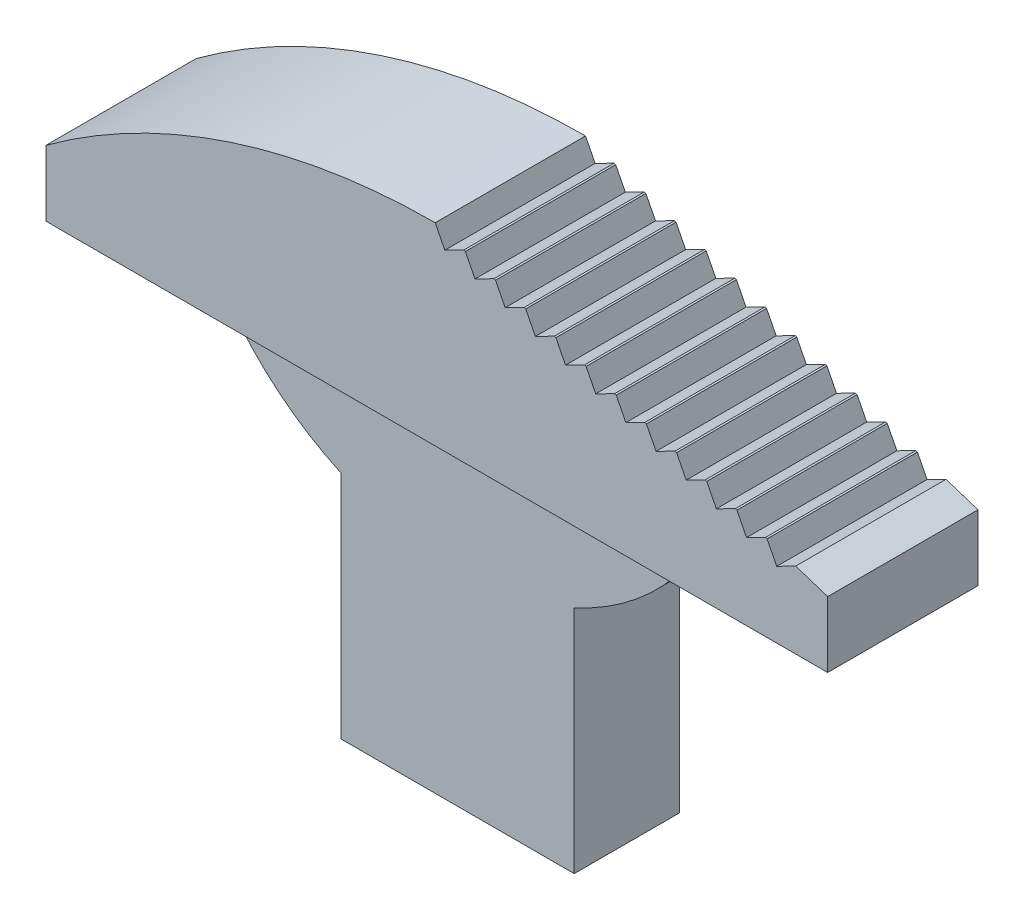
from build123d import *

# Parameters (mm, degrees)
BOSS_EXTRUDE1_DEPTH = 1.4224
BOSS_EXTRUDE2_START = -0.7112
BOSS_EXTRUDE2_DEPTH = 1.016
CUT_EXTRUDE1_DEPTH  = 12.614375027


with BuildPart() as part:
    # Sketch1 → Boss-Extrude1 (new body)
    with BuildSketch(Plane.XY):
        with BuildLine():
            Line((0, 0), (2.157309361, 0))
            ThreePointArc((2.157309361, 0), (2.838467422, -0.730853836), (3.686198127, -1.259509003))
            Line((3.686198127, -1.259509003), (3.686198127, -4.372170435))
            Line((3.686198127, -4.372170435), (6.835798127, -4.372170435))
            Line((6.835798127, -4.372170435), (6.835798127, -1.259509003))
            ThreePointArc((6.835798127, -1.259509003), (7.683528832, -0.730853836), (8.364686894, 0))
            Line((8.364686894, 0), (10.5664, 0))
            Line((10.5664, 0), (10.5664, 0.889))
            Line((10.5664, 0.889), (5.260998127, 2.612829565))
            ThreePointArc((5.260998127, 2.612829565), (2.492890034, 2.170887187), (0, 0.889))
            Line((0, 0.889), (0, 0))
        make_face()
    extrude(amount=BOSS_EXTRUDE1_DEPTH)

    # Sketch2 → Boss-Extrude2 (add, symmetric)
    with BuildSketch(Plane.XY.offset(1.4224).offset(BOSS_EXTRUDE2_START)):
        with BuildLine():
            Line((10.5664, 0), (0, 0))
            Line((0, 0), (0, 0.889))
            ThreePointArc((0, 0.889), (2.492890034, 2.170887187), (5.260998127, 2.612829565))
            Line((5.260998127, 2.612829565), (10.5664, 0.889))
            Line((10.5664, 0.889), (10.5664, 0))
        make_face()
    extrude(amount=BOSS_EXTRUDE2_DEPTH, both=True)

    # Sketch3 → Cut-Extrude1 (cut, through all)
    with BuildSketch(Plane(origin=(0, 0, 1.7272), x_dir=(0.9510565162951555, -0.3090169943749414, 0), z_dir=(0, 0, 1))):
        Polygon((4.196097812, 4.110686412), (4.399297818, 3.907486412), (4.602497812, 4.110686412), align=None)
        Polygon((4.828134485, 3.907486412), (5.031334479, 4.110686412), (4.624934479, 4.110686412), align=None)
        Polygon((5.256971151, 3.907486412), (5.460171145, 4.110686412), (5.053771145, 4.110686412), align=None)
        Polygon((5.685807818, 3.907486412), (5.889007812, 4.110686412), (5.482607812, 4.110686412), align=None)
        Polygon((6.114644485, 3.907486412), (6.317844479, 4.110686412), (5.911444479, 4.110686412), align=None)
        Polygon((6.543481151, 3.907486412), (6.746681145, 4.110686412), (6.340281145, 4.110686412), align=None)
        Polygon((6.972317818, 3.907486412), (7.175517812, 4.110686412), (6.769117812, 4.110686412), align=None)
        Polygon((7.401154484, 3.907486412), (7.604354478, 4.110686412), (7.197954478, 4.110686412), align=None)
        Polygon((7.829991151, 3.907486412), (8.033191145, 4.110686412), (7.626791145, 4.110686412), align=None)
        Polygon((8.258827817, 3.907486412), (8.462027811, 4.110686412), (8.055627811, 4.110686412), align=None)
        Polygon((8.687664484, 3.907486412), (8.890864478, 4.110686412), (8.484464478, 4.110686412), align=None)
        Polygon((9.116501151, 3.907486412), (9.319701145, 4.110686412), (8.913301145, 4.110686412), align=None)
    extrude(amount=-CUT_EXTRUDE1_DEPTH, mode=Mode.SUBTRACT)


solid = part.part
